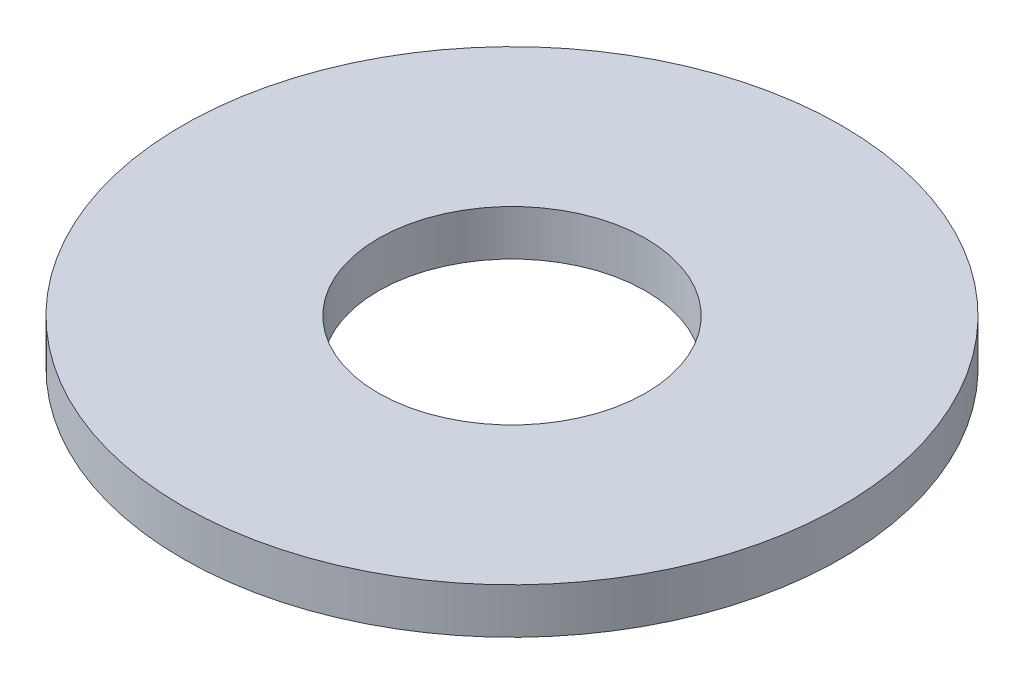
ISO-10303-21;
HEADER;
FILE_DESCRIPTION(('STEP AP214'),'2;1');
FILE_NAME('part.step','',(''),(''),'','','');
FILE_SCHEMA(('AUTOMOTIVE_DESIGN { 1 0 10303 214 1 1 1 1 }'));
ENDSEC;
DATA;
#1=APPLICATION_CONTEXT('core data for automotive mechanical design processes');
#2=APPLICATION_PROTOCOL_DEFINITION('international standard','automotive_design',2000,#1);
#3=PRODUCT_CONTEXT('',#1,'mechanical');
#4=PRODUCT('Part','Part','',(#3));
#5=PRODUCT_RELATED_PRODUCT_CATEGORY('part','',(#4));
#6=PRODUCT_DEFINITION_FORMATION('','',#4);
#7=PRODUCT_DEFINITION_CONTEXT('part definition',#1,'design');
#8=PRODUCT_DEFINITION('design','',#6,#7);
#9=PRODUCT_DEFINITION_SHAPE('','',#8);
#10=(LENGTH_UNIT() NAMED_UNIT(*) SI_UNIT(.MILLI.,.METRE.));
#11=(NAMED_UNIT(*) PLANE_ANGLE_UNIT() SI_UNIT($,.RADIAN.));
#12=(NAMED_UNIT(*) SI_UNIT($,.STERADIAN.) SOLID_ANGLE_UNIT());
#13=UNCERTAINTY_MEASURE_WITH_UNIT(LENGTH_MEASURE(1.E-05),#10,'distance_accuracy_value','');
#14=(GEOMETRIC_REPRESENTATION_CONTEXT(3) GLOBAL_UNCERTAINTY_ASSIGNED_CONTEXT((#13)) GLOBAL_UNIT_ASSIGNED_CONTEXT((#10,
#11,#12)) REPRESENTATION_CONTEXT('',''));
#15=CARTESIAN_POINT('',(0.,0.,0.));
#16=DIRECTION('',(0.,0.,1.));
#17=DIRECTION('',(1.,0.,0.));
#18=AXIS2_PLACEMENT_3D('',#15,#16,#17);
#19=CARTESIAN_POINT('',(0.,1.7526,0.));
#20=DIRECTION('',(0.,1.,0.));
#21=DIRECTION('',(0.,0.,1.));
#22=AXIS2_PLACEMENT_3D('',#19,#20,#21);
#23=PLANE('',#22);
#24=CARTESIAN_POINT('',(0.,1.7526,0.));
#25=DIRECTION('',(0.,1.,0.));
#26=DIRECTION('',(0.,0.,1.));
#27=AXIS2_PLACEMENT_3D('',#24,#25,#26);
#28=CIRCLE('',#27,12.7);
#29=CARTESIAN_POINT('',(0.,1.7526,12.7));
#30=VERTEX_POINT('',#29);
#31=EDGE_CURVE('E10',#30,#30,#28,.T.);
#32=ORIENTED_EDGE('',*,*,#31,.T.);
#33=EDGE_LOOP('',(#32));
#34=FACE_BOUND('',#33,.T.);
#35=CARTESIAN_POINT('',(0.,1.7526,0.));
#36=DIRECTION('',(0.,1.,0.));
#37=DIRECTION('',(0.,0.,1.));
#38=AXIS2_PLACEMENT_3D('',#35,#36,#37);
#39=CIRCLE('',#38,5.1562);
#40=CARTESIAN_POINT('',(0.,1.7526,5.1562));
#41=VERTEX_POINT('',#40);
#42=EDGE_CURVE('E45',#41,#41,#39,.T.);
#43=ORIENTED_EDGE('',*,*,#42,.F.);
#44=EDGE_LOOP('',(#43));
#45=FACE_BOUND('',#44,.T.);
#46=ADVANCED_FACE('F34',(#34,#45),#23,.T.);
#47=CARTESIAN_POINT('',(0.,0.,0.));
#48=DIRECTION('',(0.,1.,0.));
#49=DIRECTION('',(0.,0.,1.));
#50=AXIS2_PLACEMENT_3D('',#47,#48,#49);
#51=PLANE('',#50);
#52=CARTESIAN_POINT('',(0.,0.,0.));
#53=DIRECTION('',(0.,1.,0.));
#54=DIRECTION('',(0.,0.,1.));
#55=AXIS2_PLACEMENT_3D('',#52,#53,#54);
#56=CIRCLE('',#55,12.7);
#57=CARTESIAN_POINT('',(0.,0.,12.7));
#58=VERTEX_POINT('',#57);
#59=EDGE_CURVE('E41',#58,#58,#56,.T.);
#60=ORIENTED_EDGE('',*,*,#59,.F.);
#61=EDGE_LOOP('',(#60));
#62=FACE_BOUND('',#61,.T.);
#63=CARTESIAN_POINT('',(0.,0.,0.));
#64=DIRECTION('',(0.,1.,0.));
#65=DIRECTION('',(0.,0.,1.));
#66=AXIS2_PLACEMENT_3D('',#63,#64,#65);
#67=CIRCLE('',#66,5.1562);
#68=CARTESIAN_POINT('',(0.,0.,5.1562));
#69=VERTEX_POINT('',#68);
#70=EDGE_CURVE('E49',#69,#69,#67,.T.);
#71=ORIENTED_EDGE('',*,*,#70,.T.);
#72=EDGE_LOOP('',(#71));
#73=FACE_BOUND('',#72,.T.);
#74=ADVANCED_FACE('F55',(#62,#73),#51,.F.);
#75=CARTESIAN_POINT('',(0.,1.7526,0.));
#76=DIRECTION('',(0.,-1.,0.));
#77=DIRECTION('',(0.,0.,-1.));
#78=AXIS2_PLACEMENT_3D('',#75,#76,#77);
#79=CYLINDRICAL_SURFACE('',#78,12.7);
#80=ORIENTED_EDGE('',*,*,#31,.F.);
#81=EDGE_LOOP('',(#80));
#82=FACE_BOUND('',#81,.T.);
#83=ORIENTED_EDGE('',*,*,#59,.T.);
#84=EDGE_LOOP('',(#83));
#85=FACE_BOUND('',#84,.T.);
#86=ADVANCED_FACE('F36',(#82,#85),#79,.T.);
#87=CARTESIAN_POINT('',(0.,1.7526,0.));
#88=DIRECTION('',(0.,-1.,0.));
#89=DIRECTION('',(0.,0.,-1.));
#90=AXIS2_PLACEMENT_3D('',#87,#88,#89);
#91=CYLINDRICAL_SURFACE('',#90,5.1562);
#92=ORIENTED_EDGE('',*,*,#42,.T.);
#93=EDGE_LOOP('',(#92));
#94=FACE_BOUND('',#93,.T.);
#95=ORIENTED_EDGE('',*,*,#70,.F.);
#96=EDGE_LOOP('',(#95));
#97=FACE_BOUND('',#96,.T.);
#98=ADVANCED_FACE('F57',(#94,#97),#91,.F.);
#99=CLOSED_SHELL('',(#46,#74,#86,#98));
#100=MANIFOLD_SOLID_BREP('B2',#99);
#101=ADVANCED_BREP_SHAPE_REPRESENTATION('',(#18,#100),#14);
#102=SHAPE_DEFINITION_REPRESENTATION(#9,#101);
ENDSEC;
END-ISO-10303-21;
